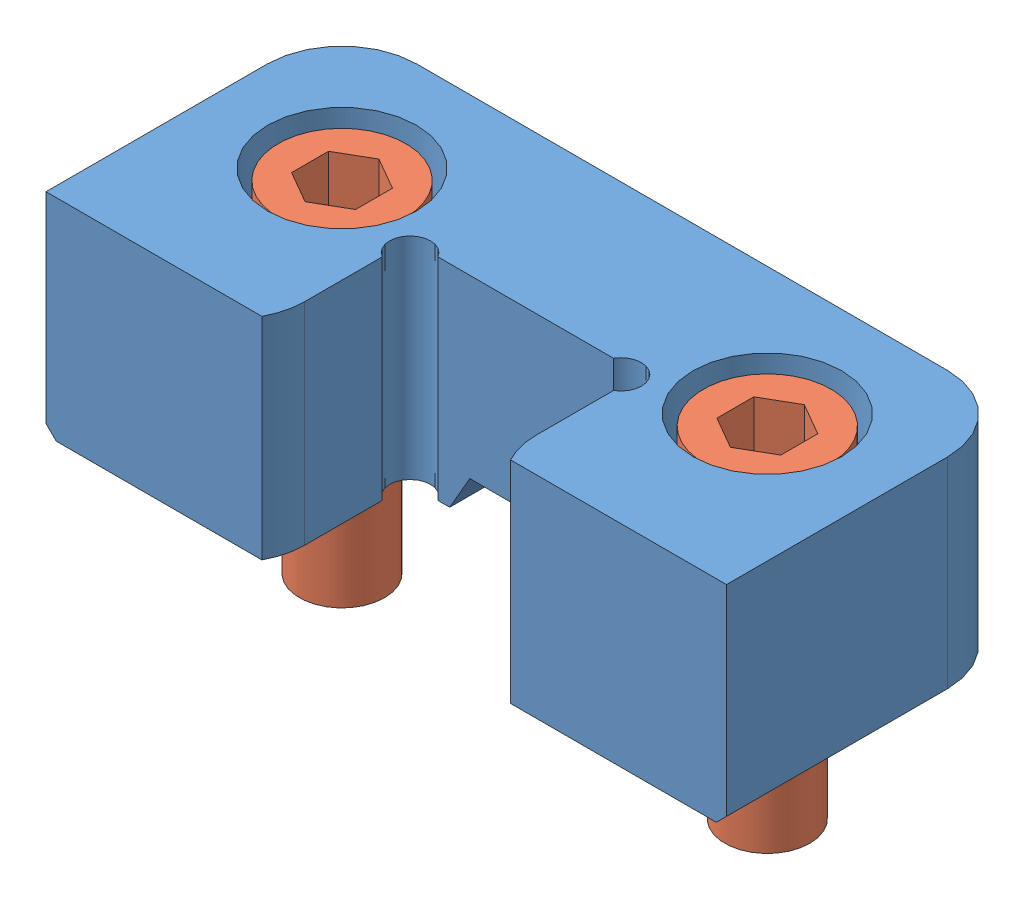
SolidWorks assembly SL62X200-F.SLDASM, configuration Default (file format 13000). Lengths in mm.
Overall size (50.8 26.19 22.1).
3 component instances, 2 part files, 5 mates.
Components (placement in the parent):
- SL62X200 FEMALE-1: SL62X200 FEMALE.sldprt [Default] at origin size (50.8 15.75 22.1)
- SHCS25-20L.75-1: SHCS25-20L.75.sldprt [SHCS25-20L.75] at (15.875 -7.1437 -12.573) x (1 0 0) z (0 -1 0) size (9.53 9.53 25.4)
- SHCS25-20L.75-2: SHCS25-20L.75.sldprt [SHCS25-20L.75] at (-15.875 -7.1437 -12.573) x (1 0 0) z (0 -1 0) size (9.53 9.53 25.4)
Mates (geometry in assembly coordinates):
- Coincident1: coincident anti-aligned: plane of SLC62X200 FEMALE-1 through (19.1389 -7.1437 -12.573) normal (0 1 0); plane of SHCS25L.75-1 through (15.875 -7.1437 -15.748) normal (0 -1 0)
- Concentric1: concentric anti-aligned: cylinder of SLC62X200 FEMALE-1 through (15.875 0 -12.573) axis (0 1 0) radius 3.2639; cylinder of SHCS25L.75-1 through (15.875 -26.1937 -12.573) axis (0 -1 0) radius 3.175
- Coincident2: coincident aligned: plane of SLC62X200 FEMALE-1 through (0 0 0) normal (0 0 1); plane of assembly through (0 0 0) normal (0 0 1)
- Coincident3: coincident aligned: plane of SLC62X200 FEMALE-1 through (0 0 0) normal (0 1 0); plane of assembly through (0 0 0) normal (0 1 0)
- Coincident4: coincident aligned: plane of SLC62X200 FEMALE-1 through (0 0 0) normal (1 0 0); plane of assembly through (0 0 0) normal (1 0 0)
